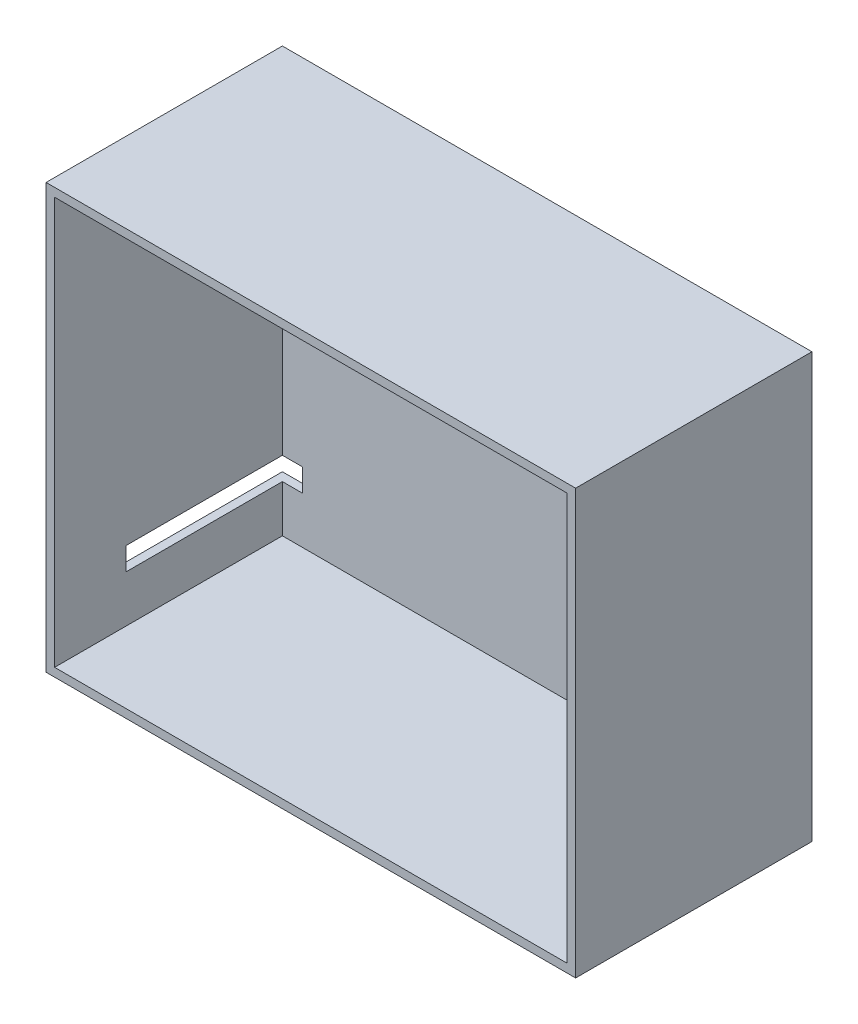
ISO-10303-21;
HEADER;
FILE_DESCRIPTION(('STEP AP214'),'2;1');
FILE_NAME('part.step','',(''),(''),'','','');
FILE_SCHEMA(('AUTOMOTIVE_DESIGN { 1 0 10303 214 1 1 1 1 }'));
ENDSEC;
DATA;
#1=APPLICATION_CONTEXT('core data for automotive mechanical design processes');
#2=APPLICATION_PROTOCOL_DEFINITION('international standard','automotive_design',2000,#1);
#3=PRODUCT_CONTEXT('',#1,'mechanical');
#4=PRODUCT('Part','Part','',(#3));
#5=PRODUCT_RELATED_PRODUCT_CATEGORY('part','',(#4));
#6=PRODUCT_DEFINITION_FORMATION('','',#4);
#7=PRODUCT_DEFINITION_CONTEXT('part definition',#1,'design');
#8=PRODUCT_DEFINITION('design','',#6,#7);
#9=PRODUCT_DEFINITION_SHAPE('','',#8);
#10=(LENGTH_UNIT() NAMED_UNIT(*) SI_UNIT(.MILLI.,.METRE.));
#11=(NAMED_UNIT(*) PLANE_ANGLE_UNIT() SI_UNIT($,.RADIAN.));
#12=(NAMED_UNIT(*) SI_UNIT($,.STERADIAN.) SOLID_ANGLE_UNIT());
#13=UNCERTAINTY_MEASURE_WITH_UNIT(LENGTH_MEASURE(1.E-05),#10,'distance_accuracy_value','');
#14=(GEOMETRIC_REPRESENTATION_CONTEXT(3) GLOBAL_UNCERTAINTY_ASSIGNED_CONTEXT((#13)) GLOBAL_UNIT_ASSIGNED_CONTEXT((#10,
#11,#12)) REPRESENTATION_CONTEXT('',''));
#15=CARTESIAN_POINT('',(0.,0.,0.));
#16=DIRECTION('',(0.,0.,1.));
#17=DIRECTION('',(1.,0.,0.));
#18=AXIS2_PLACEMENT_3D('',#15,#16,#17);
#19=CARTESIAN_POINT('',(0.,0.,3.));
#20=DIRECTION('',(1.,0.,0.));
#21=DIRECTION('',(0.,0.,-1.));
#22=AXIS2_PLACEMENT_3D('',#19,#20,#21);
#23=PLANE('',#22);
#24=DIRECTION('',(0.,0.,1.));
#25=VECTOR('',#24,1.);
#26=CARTESIAN_POINT('',(0.,19.5,3.));
#27=LINE('',#26,#25);
#28=CARTESIAN_POINT('',(0.,19.5,0.));
#29=VERTEX_POINT('',#28);
#30=CARTESIAN_POINT('',(0.,19.5,58.));
#31=VERTEX_POINT('',#30);
#32=EDGE_CURVE('E174',#29,#31,#27,.T.);
#33=ORIENTED_EDGE('',*,*,#32,.F.);
#34=DIRECTION('',(0.,-1.,0.));
#35=VECTOR('',#34,1.);
#36=CARTESIAN_POINT('',(0.,0.,0.));
#37=LINE('',#36,#35);
#38=CARTESIAN_POINT('',(0.,0.,0.));
#39=VERTEX_POINT('',#38);
#40=EDGE_CURVE('E156',#29,#39,#37,.T.);
#41=ORIENTED_EDGE('',*,*,#40,.T.);
#42=DIRECTION('',(0.,0.,-1.));
#43=VECTOR('',#42,1.);
#44=CARTESIAN_POINT('',(0.,0.,3.));
#45=LINE('',#44,#43);
#46=CARTESIAN_POINT('',(0.,0.,83.));
#47=VERTEX_POINT('',#46);
#48=EDGE_CURVE('E239',#47,#39,#45,.T.);
#49=ORIENTED_EDGE('',*,*,#48,.F.);
#50=DIRECTION('',(0.,-1.,0.));
#51=VECTOR('',#50,1.);
#52=CARTESIAN_POINT('',(0.,0.,83.));
#53=LINE('',#52,#51);
#54=CARTESIAN_POINT('',(0.,149.,83.));
#55=VERTEX_POINT('',#54);
#56=EDGE_CURVE('E198',#55,#47,#53,.T.);
#57=ORIENTED_EDGE('',*,*,#56,.F.);
#58=DIRECTION('',(0.,0.,-1.));
#59=VECTOR('',#58,1.);
#60=CARTESIAN_POINT('',(0.,149.,3.));
#61=LINE('',#60,#59);
#62=CARTESIAN_POINT('',(0.,149.,0.));
#63=VERTEX_POINT('',#62);
#64=EDGE_CURVE('E226',#55,#63,#61,.T.);
#65=ORIENTED_EDGE('',*,*,#64,.T.);
#66=CARTESIAN_POINT('',(0.,27.5,0.));
#67=VERTEX_POINT('',#66);
#68=EDGE_CURVE('E222',#63,#67,#37,.T.);
#69=ORIENTED_EDGE('',*,*,#68,.T.);
#70=DIRECTION('',(0.,0.,-1.));
#71=VECTOR('',#70,1.);
#72=CARTESIAN_POINT('',(0.,27.5,3.));
#73=LINE('',#72,#71);
#74=CARTESIAN_POINT('',(0.,27.5,58.));
#75=VERTEX_POINT('',#74);
#76=EDGE_CURVE('E170',#75,#67,#73,.T.);
#77=ORIENTED_EDGE('',*,*,#76,.F.);
#78=DIRECTION('',(0.,1.,0.));
#79=VECTOR('',#78,1.);
#80=CARTESIAN_POINT('',(0.,0.,58.));
#81=LINE('',#80,#79);
#82=EDGE_CURVE('E175',#31,#75,#81,.T.);
#83=ORIENTED_EDGE('',*,*,#82,.F.);
#84=EDGE_LOOP('',(#33,#41,#49,#57,#65,#69,#77,#83));
#85=FACE_BOUND('',#84,.T.);
#86=ADVANCED_FACE('F37',(#85),#23,.F.);
#87=CARTESIAN_POINT('',(0.,0.,0.));
#88=DIRECTION('',(0.,0.,-1.));
#89=DIRECTION('',(-1.,0.,0.));
#90=AXIS2_PLACEMENT_3D('',#87,#88,#89);
#91=PLANE('',#90);
#92=DIRECTION('',(0.,1.,0.));
#93=VECTOR('',#92,1.);
#94=CARTESIAN_POINT('',(10.,19.5,0.));
#95=LINE('',#94,#93);
#96=CARTESIAN_POINT('',(10.,19.5,0.));
#97=VERTEX_POINT('',#96);
#98=CARTESIAN_POINT('',(10.,27.5,0.));
#99=VERTEX_POINT('',#98);
#100=EDGE_CURVE('E149',#97,#99,#95,.T.);
#101=ORIENTED_EDGE('',*,*,#100,.T.);
#102=DIRECTION('',(-1.,0.,0.));
#103=VECTOR('',#102,1.);
#104=CARTESIAN_POINT('',(-1.,27.5,0.));
#105=LINE('',#104,#103);
#106=EDGE_CURVE('E53',#99,#67,#105,.T.);
#107=ORIENTED_EDGE('',*,*,#106,.T.);
#108=ORIENTED_EDGE('',*,*,#68,.F.);
#109=DIRECTION('',(-1.,0.,0.));
#110=VECTOR('',#109,1.);
#111=CARTESIAN_POINT('',(0.,149.,0.));
#112=LINE('',#111,#110);
#113=CARTESIAN_POINT('',(186.,149.,0.));
#114=VERTEX_POINT('',#113);
#115=EDGE_CURVE('E227',#114,#63,#112,.T.);
#116=ORIENTED_EDGE('',*,*,#115,.F.);
#117=DIRECTION('',(0.,1.,0.));
#118=VECTOR('',#117,1.);
#119=CARTESIAN_POINT('',(186.,0.,0.));
#120=LINE('',#119,#118);
#121=CARTESIAN_POINT('',(186.,0.,0.));
#122=VERTEX_POINT('',#121);
#123=EDGE_CURVE('E228',#122,#114,#120,.T.);
#124=ORIENTED_EDGE('',*,*,#123,.F.);
#125=DIRECTION('',(1.,0.,0.));
#126=VECTOR('',#125,1.);
#127=CARTESIAN_POINT('',(0.,0.,0.));
#128=LINE('',#127,#126);
#129=EDGE_CURVE('E221',#39,#122,#128,.T.);
#130=ORIENTED_EDGE('',*,*,#129,.F.);
#131=ORIENTED_EDGE('',*,*,#40,.F.);
#132=DIRECTION('',(1.,0.,0.));
#133=VECTOR('',#132,1.);
#134=CARTESIAN_POINT('',(-1.,19.5,0.));
#135=LINE('',#134,#133);
#136=EDGE_CURVE('E143',#29,#97,#135,.T.);
#137=ORIENTED_EDGE('',*,*,#136,.T.);
#138=EDGE_LOOP('',(#101,#107,#108,#116,#124,#130,#131,#137));
#139=FACE_BOUND('',#138,.T.);
#140=ADVANCED_FACE('F152',(#139),#91,.T.);
#141=CARTESIAN_POINT('',(3.,3.,83.));
#142=DIRECTION('',(1.,0.,0.));
#143=DIRECTION('',(0.,0.,-1.));
#144=AXIS2_PLACEMENT_3D('',#141,#142,#143);
#145=PLANE('',#144);
#146=DIRECTION('',(0.,-1.,0.));
#147=VECTOR('',#146,1.);
#148=CARTESIAN_POINT('',(3.,0.,3.));
#149=LINE('',#148,#147);
#150=CARTESIAN_POINT('',(3.,19.5,3.));
#151=VERTEX_POINT('',#150);
#152=CARTESIAN_POINT('',(3.,3.,3.));
#153=VERTEX_POINT('',#152);
#154=EDGE_CURVE('E220',#151,#153,#149,.T.);
#155=ORIENTED_EDGE('',*,*,#154,.F.);
#156=DIRECTION('',(0.,0.,1.));
#157=VECTOR('',#156,1.);
#158=CARTESIAN_POINT('',(3.,19.5,83.));
#159=LINE('',#158,#157);
#160=CARTESIAN_POINT('',(3.,19.5,58.));
#161=VERTEX_POINT('',#160);
#162=EDGE_CURVE('E166',#151,#161,#159,.T.);
#163=ORIENTED_EDGE('',*,*,#162,.T.);
#164=DIRECTION('',(0.,1.,0.));
#165=VECTOR('',#164,1.);
#166=CARTESIAN_POINT('',(3.,3.,58.));
#167=LINE('',#166,#165);
#168=CARTESIAN_POINT('',(3.,27.5,58.));
#169=VERTEX_POINT('',#168);
#170=EDGE_CURVE('E11',#161,#169,#167,.T.);
#171=ORIENTED_EDGE('',*,*,#170,.T.);
#172=DIRECTION('',(0.,0.,-1.));
#173=VECTOR('',#172,1.);
#174=CARTESIAN_POINT('',(3.,27.5,83.));
#175=LINE('',#174,#173);
#176=CARTESIAN_POINT('',(3.,27.5,3.));
#177=VERTEX_POINT('',#176);
#178=EDGE_CURVE('E148',#169,#177,#175,.T.);
#179=ORIENTED_EDGE('',*,*,#178,.T.);
#180=CARTESIAN_POINT('',(3.,146.,3.));
#181=VERTEX_POINT('',#180);
#182=EDGE_CURVE('E217',#181,#177,#149,.T.);
#183=ORIENTED_EDGE('',*,*,#182,.F.);
#184=DIRECTION('',(0.,0.,-1.));
#185=VECTOR('',#184,1.);
#186=CARTESIAN_POINT('',(3.,146.,83.));
#187=LINE('',#186,#185);
#188=CARTESIAN_POINT('',(3.,146.,83.));
#189=VERTEX_POINT('',#188);
#190=EDGE_CURVE('E183',#189,#181,#187,.T.);
#191=ORIENTED_EDGE('',*,*,#190,.F.);
#192=DIRECTION('',(0.,-1.,0.));
#193=VECTOR('',#192,1.);
#194=CARTESIAN_POINT('',(3.,3.,83.));
#195=LINE('',#194,#193);
#196=CARTESIAN_POINT('',(3.,3.,83.));
#197=VERTEX_POINT('',#196);
#198=EDGE_CURVE('E176',#189,#197,#195,.T.);
#199=ORIENTED_EDGE('',*,*,#198,.T.);
#200=DIRECTION('',(0.,0.,-1.));
#201=VECTOR('',#200,1.);
#202=CARTESIAN_POINT('',(3.,3.,83.));
#203=LINE('',#202,#201);
#204=EDGE_CURVE('E192',#197,#153,#203,.T.);
#205=ORIENTED_EDGE('',*,*,#204,.T.);
#206=EDGE_LOOP('',(#155,#163,#171,#179,#183,#191,#199,#205));
#207=FACE_BOUND('',#206,.T.);
#208=ADVANCED_FACE('F255',(#207),#145,.T.);
#209=CARTESIAN_POINT('',(0.,0.,3.));
#210=DIRECTION('',(0.,0.,-1.));
#211=DIRECTION('',(-1.,0.,0.));
#212=AXIS2_PLACEMENT_3D('',#209,#210,#211);
#213=PLANE('',#212);
#214=DIRECTION('',(1.,0.,0.));
#215=VECTOR('',#214,1.);
#216=CARTESIAN_POINT('',(0.,19.5,3.));
#217=LINE('',#216,#215);
#218=CARTESIAN_POINT('',(10.,19.5,3.00000000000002));
#219=VERTEX_POINT('',#218);
#220=EDGE_CURVE('E50',#151,#219,#217,.T.);
#221=ORIENTED_EDGE('',*,*,#220,.F.);
#222=ORIENTED_EDGE('',*,*,#154,.T.);
#223=DIRECTION('',(1.,0.,0.));
#224=VECTOR('',#223,1.);
#225=CARTESIAN_POINT('',(0.,3.,3.));
#226=LINE('',#225,#224);
#227=CARTESIAN_POINT('',(183.,3.,3.));
#228=VERTEX_POINT('',#227);
#229=EDGE_CURVE('E212',#153,#228,#226,.T.);
#230=ORIENTED_EDGE('',*,*,#229,.T.);
#231=DIRECTION('',(0.,1.,0.));
#232=VECTOR('',#231,1.);
#233=CARTESIAN_POINT('',(183.,0.,3.));
#234=LINE('',#233,#232);
#235=CARTESIAN_POINT('',(183.,146.,3.));
#236=VERTEX_POINT('',#235);
#237=EDGE_CURVE('E211',#228,#236,#234,.T.);
#238=ORIENTED_EDGE('',*,*,#237,.T.);
#239=DIRECTION('',(-1.,0.,0.));
#240=VECTOR('',#239,1.);
#241=CARTESIAN_POINT('',(0.,146.,3.));
#242=LINE('',#241,#240);
#243=EDGE_CURVE('E208',#236,#181,#242,.T.);
#244=ORIENTED_EDGE('',*,*,#243,.T.);
#245=ORIENTED_EDGE('',*,*,#182,.T.);
#246=DIRECTION('',(-1.,0.,0.));
#247=VECTOR('',#246,1.);
#248=CARTESIAN_POINT('',(0.,27.5,3.));
#249=LINE('',#248,#247);
#250=CARTESIAN_POINT('',(10.,27.5,3.));
#251=VERTEX_POINT('',#250);
#252=EDGE_CURVE('E244',#251,#177,#249,.T.);
#253=ORIENTED_EDGE('',*,*,#252,.F.);
#254=DIRECTION('',(0.,1.,0.));
#255=VECTOR('',#254,1.);
#256=CARTESIAN_POINT('',(10.,0.,3.));
#257=LINE('',#256,#255);
#258=EDGE_CURVE('E245',#219,#251,#257,.T.);
#259=ORIENTED_EDGE('',*,*,#258,.F.);
#260=EDGE_LOOP('',(#221,#222,#230,#238,#244,#245,#253,#259));
#261=FACE_BOUND('',#260,.T.);
#262=ADVANCED_FACE('F250',(#261),#213,.F.);
#263=CARTESIAN_POINT('',(0.,0.,3.));
#264=DIRECTION('',(0.,1.,0.));
#265=DIRECTION('',(0.,0.,1.));
#266=AXIS2_PLACEMENT_3D('',#263,#264,#265);
#267=PLANE('',#266);
#268=ORIENTED_EDGE('',*,*,#129,.T.);
#269=DIRECTION('',(0.,0.,-1.));
#270=VECTOR('',#269,1.);
#271=CARTESIAN_POINT('',(186.,0.,3.));
#272=LINE('',#271,#270);
#273=CARTESIAN_POINT('',(186.,0.,83.));
#274=VERTEX_POINT('',#273);
#275=EDGE_CURVE('E237',#274,#122,#272,.T.);
#276=ORIENTED_EDGE('',*,*,#275,.F.);
#277=DIRECTION('',(1.,0.,0.));
#278=VECTOR('',#277,1.);
#279=CARTESIAN_POINT('',(0.,0.,83.));
#280=LINE('',#279,#278);
#281=EDGE_CURVE('E200',#47,#274,#280,.T.);
#282=ORIENTED_EDGE('',*,*,#281,.F.);
#283=ORIENTED_EDGE('',*,*,#48,.T.);
#284=EDGE_LOOP('',(#268,#276,#282,#283));
#285=FACE_BOUND('',#284,.T.);
#286=ADVANCED_FACE('F279',(#285),#267,.F.);
#287=CARTESIAN_POINT('',(186.,0.,3.));
#288=DIRECTION('',(-1.,0.,0.));
#289=DIRECTION('',(0.,0.,1.));
#290=AXIS2_PLACEMENT_3D('',#287,#288,#289);
#291=PLANE('',#290);
#292=ORIENTED_EDGE('',*,*,#123,.T.);
#293=DIRECTION('',(0.,0.,-1.));
#294=VECTOR('',#293,1.);
#295=CARTESIAN_POINT('',(186.,149.,3.));
#296=LINE('',#295,#294);
#297=CARTESIAN_POINT('',(186.,149.,83.));
#298=VERTEX_POINT('',#297);
#299=EDGE_CURVE('E232',#298,#114,#296,.T.);
#300=ORIENTED_EDGE('',*,*,#299,.F.);
#301=DIRECTION('',(0.,1.,0.));
#302=VECTOR('',#301,1.);
#303=CARTESIAN_POINT('',(186.,0.,83.));
#304=LINE('',#303,#302);
#305=EDGE_CURVE('E205',#274,#298,#304,.T.);
#306=ORIENTED_EDGE('',*,*,#305,.F.);
#307=ORIENTED_EDGE('',*,*,#275,.T.);
#308=EDGE_LOOP('',(#292,#300,#306,#307));
#309=FACE_BOUND('',#308,.T.);
#310=ADVANCED_FACE('F275',(#309),#291,.F.);
#311=CARTESIAN_POINT('',(0.,149.,3.));
#312=DIRECTION('',(0.,-1.,0.));
#313=DIRECTION('',(0.,0.,-1.));
#314=AXIS2_PLACEMENT_3D('',#311,#312,#313);
#315=PLANE('',#314);
#316=ORIENTED_EDGE('',*,*,#115,.T.);
#317=ORIENTED_EDGE('',*,*,#64,.F.);
#318=DIRECTION('',(-1.,0.,0.));
#319=VECTOR('',#318,1.);
#320=CARTESIAN_POINT('',(0.,149.,83.));
#321=LINE('',#320,#319);
#322=EDGE_CURVE('E202',#298,#55,#321,.T.);
#323=ORIENTED_EDGE('',*,*,#322,.F.);
#324=ORIENTED_EDGE('',*,*,#299,.T.);
#325=EDGE_LOOP('',(#316,#317,#323,#324));
#326=FACE_BOUND('',#325,.T.);
#327=ADVANCED_FACE('F268',(#326),#315,.F.);
#328=CARTESIAN_POINT('',(3.,3.,83.));
#329=DIRECTION('',(0.,1.,0.));
#330=DIRECTION('',(0.,0.,1.));
#331=AXIS2_PLACEMENT_3D('',#328,#329,#330);
#332=PLANE('',#331);
#333=ORIENTED_EDGE('',*,*,#229,.F.);
#334=ORIENTED_EDGE('',*,*,#204,.F.);
#335=DIRECTION('',(1.,0.,0.));
#336=VECTOR('',#335,1.);
#337=CARTESIAN_POINT('',(3.,3.,83.));
#338=LINE('',#337,#336);
#339=CARTESIAN_POINT('',(183.,3.,83.));
#340=VERTEX_POINT('',#339);
#341=EDGE_CURVE('E177',#197,#340,#338,.T.);
#342=ORIENTED_EDGE('',*,*,#341,.T.);
#343=DIRECTION('',(0.,0.,-1.));
#344=VECTOR('',#343,1.);
#345=CARTESIAN_POINT('',(183.,3.,83.));
#346=LINE('',#345,#344);
#347=EDGE_CURVE('E186',#340,#228,#346,.T.);
#348=ORIENTED_EDGE('',*,*,#347,.T.);
#349=EDGE_LOOP('',(#333,#334,#342,#348));
#350=FACE_BOUND('',#349,.T.);
#351=ADVANCED_FACE('F300',(#350),#332,.T.);
#352=CARTESIAN_POINT('',(183.,3.,83.));
#353=DIRECTION('',(-1.,0.,0.));
#354=DIRECTION('',(0.,0.,1.));
#355=AXIS2_PLACEMENT_3D('',#352,#353,#354);
#356=PLANE('',#355);
#357=ORIENTED_EDGE('',*,*,#237,.F.);
#358=ORIENTED_EDGE('',*,*,#347,.F.);
#359=DIRECTION('',(0.,1.,0.));
#360=VECTOR('',#359,1.);
#361=CARTESIAN_POINT('',(183.,3.,83.));
#362=LINE('',#361,#360);
#363=CARTESIAN_POINT('',(183.,146.,83.));
#364=VERTEX_POINT('',#363);
#365=EDGE_CURVE('E179',#340,#364,#362,.T.);
#366=ORIENTED_EDGE('',*,*,#365,.T.);
#367=DIRECTION('',(0.,0.,-1.));
#368=VECTOR('',#367,1.);
#369=CARTESIAN_POINT('',(183.,146.,83.));
#370=LINE('',#369,#368);
#371=EDGE_CURVE('E189',#364,#236,#370,.T.);
#372=ORIENTED_EDGE('',*,*,#371,.T.);
#373=EDGE_LOOP('',(#357,#358,#366,#372));
#374=FACE_BOUND('',#373,.T.);
#375=ADVANCED_FACE('F302',(#374),#356,.T.);
#376=CARTESIAN_POINT('',(3.,146.,83.));
#377=DIRECTION('',(0.,-1.,0.));
#378=DIRECTION('',(0.,0.,-1.));
#379=AXIS2_PLACEMENT_3D('',#376,#377,#378);
#380=PLANE('',#379);
#381=ORIENTED_EDGE('',*,*,#243,.F.);
#382=ORIENTED_EDGE('',*,*,#371,.F.);
#383=DIRECTION('',(-1.,0.,0.));
#384=VECTOR('',#383,1.);
#385=CARTESIAN_POINT('',(3.,146.,83.));
#386=LINE('',#385,#384);
#387=EDGE_CURVE('E181',#364,#189,#386,.T.);
#388=ORIENTED_EDGE('',*,*,#387,.T.);
#389=ORIENTED_EDGE('',*,*,#190,.T.);
#390=EDGE_LOOP('',(#381,#382,#388,#389));
#391=FACE_BOUND('',#390,.T.);
#392=ADVANCED_FACE('F310',(#391),#380,.T.);
#393=CARTESIAN_POINT('',(0.,0.,83.));
#394=DIRECTION('',(0.,0.,-1.));
#395=DIRECTION('',(-1.,0.,0.));
#396=AXIS2_PLACEMENT_3D('',#393,#394,#395);
#397=PLANE('',#396);
#398=ORIENTED_EDGE('',*,*,#56,.T.);
#399=ORIENTED_EDGE('',*,*,#281,.T.);
#400=ORIENTED_EDGE('',*,*,#305,.T.);
#401=ORIENTED_EDGE('',*,*,#322,.T.);
#402=EDGE_LOOP('',(#398,#399,#400,#401));
#403=FACE_BOUND('',#402,.T.);
#404=ORIENTED_EDGE('',*,*,#198,.F.);
#405=ORIENTED_EDGE('',*,*,#387,.F.);
#406=ORIENTED_EDGE('',*,*,#365,.F.);
#407=ORIENTED_EDGE('',*,*,#341,.F.);
#408=EDGE_LOOP('',(#404,#405,#406,#407));
#409=FACE_BOUND('',#408,.T.);
#410=ADVANCED_FACE('F273',(#403,#409),#397,.F.);
#411=CARTESIAN_POINT('',(0.,0.,58.));
#412=DIRECTION('',(0.,0.,-1.));
#413=DIRECTION('',(-1.,0.,0.));
#414=AXIS2_PLACEMENT_3D('',#411,#412,#413);
#415=PLANE('',#414);
#416=ORIENTED_EDGE('',*,*,#82,.T.);
#417=DIRECTION('',(-1.,0.,0.));
#418=VECTOR('',#417,1.);
#419=CARTESIAN_POINT('',(-1.,27.5,58.));
#420=LINE('',#419,#418);
#421=EDGE_CURVE('E157',#169,#75,#420,.T.);
#422=ORIENTED_EDGE('',*,*,#421,.F.);
#423=ORIENTED_EDGE('',*,*,#170,.F.);
#424=DIRECTION('',(1.,0.,0.));
#425=VECTOR('',#424,1.);
#426=CARTESIAN_POINT('',(-1.,19.5,58.));
#427=LINE('',#426,#425);
#428=EDGE_CURVE('E162',#31,#161,#427,.T.);
#429=ORIENTED_EDGE('',*,*,#428,.F.);
#430=EDGE_LOOP('',(#416,#422,#423,#429));
#431=FACE_BOUND('',#430,.T.);
#432=ADVANCED_FACE('F259',(#431),#415,.T.);
#433=CARTESIAN_POINT('',(-1.,19.5,58.));
#434=DIRECTION('',(0.,1.,0.));
#435=DIRECTION('',(0.,0.,1.));
#436=AXIS2_PLACEMENT_3D('',#433,#434,#435);
#437=PLANE('',#436);
#438=ORIENTED_EDGE('',*,*,#32,.T.);
#439=ORIENTED_EDGE('',*,*,#428,.T.);
#440=ORIENTED_EDGE('',*,*,#162,.F.);
#441=ORIENTED_EDGE('',*,*,#220,.T.);
#442=DIRECTION('',(0.,0.,-1.));
#443=VECTOR('',#442,1.);
#444=CARTESIAN_POINT('',(10.,19.5,58.));
#445=LINE('',#444,#443);
#446=EDGE_CURVE('E140',#219,#97,#445,.T.);
#447=ORIENTED_EDGE('',*,*,#446,.T.);
#448=ORIENTED_EDGE('',*,*,#136,.F.);
#449=EDGE_LOOP('',(#438,#439,#440,#441,#447,#448));
#450=FACE_BOUND('',#449,.T.);
#451=ADVANCED_FACE('F138',(#450),#437,.T.);
#452=CARTESIAN_POINT('',(10.,19.5,58.));
#453=DIRECTION('',(-1.,0.,0.));
#454=DIRECTION('',(0.,0.,1.));
#455=AXIS2_PLACEMENT_3D('',#452,#453,#454);
#456=PLANE('',#455);
#457=ORIENTED_EDGE('',*,*,#258,.T.);
#458=DIRECTION('',(0.,0.,-1.));
#459=VECTOR('',#458,1.);
#460=CARTESIAN_POINT('',(10.,27.5,58.));
#461=LINE('',#460,#459);
#462=EDGE_CURVE('E59',#251,#99,#461,.T.);
#463=ORIENTED_EDGE('',*,*,#462,.T.);
#464=ORIENTED_EDGE('',*,*,#100,.F.);
#465=ORIENTED_EDGE('',*,*,#446,.F.);
#466=EDGE_LOOP('',(#457,#463,#464,#465));
#467=FACE_BOUND('',#466,.T.);
#468=ADVANCED_FACE('F147',(#467),#456,.T.);
#469=CARTESIAN_POINT('',(-1.,27.5,58.));
#470=DIRECTION('',(0.,-1.,0.));
#471=DIRECTION('',(0.,0.,-1.));
#472=AXIS2_PLACEMENT_3D('',#469,#470,#471);
#473=PLANE('',#472);
#474=ORIENTED_EDGE('',*,*,#76,.T.);
#475=ORIENTED_EDGE('',*,*,#106,.F.);
#476=ORIENTED_EDGE('',*,*,#462,.F.);
#477=ORIENTED_EDGE('',*,*,#252,.T.);
#478=ORIENTED_EDGE('',*,*,#178,.F.);
#479=ORIENTED_EDGE('',*,*,#421,.T.);
#480=EDGE_LOOP('',(#474,#475,#476,#477,#478,#479));
#481=FACE_BOUND('',#480,.T.);
#482=ADVANCED_FACE('F248',(#481),#473,.T.);
#483=CLOSED_SHELL('',(#86,#140,#208,#262,#286,#310,#327,#351,#375,#392,#410,#432,#451,#468,#482));
#484=MANIFOLD_SOLID_BREP('B2',#483);
#485=ADVANCED_BREP_SHAPE_REPRESENTATION('',(#18,#484),#14);
#486=SHAPE_DEFINITION_REPRESENTATION(#9,#485);
ENDSEC;
END-ISO-10303-21;
